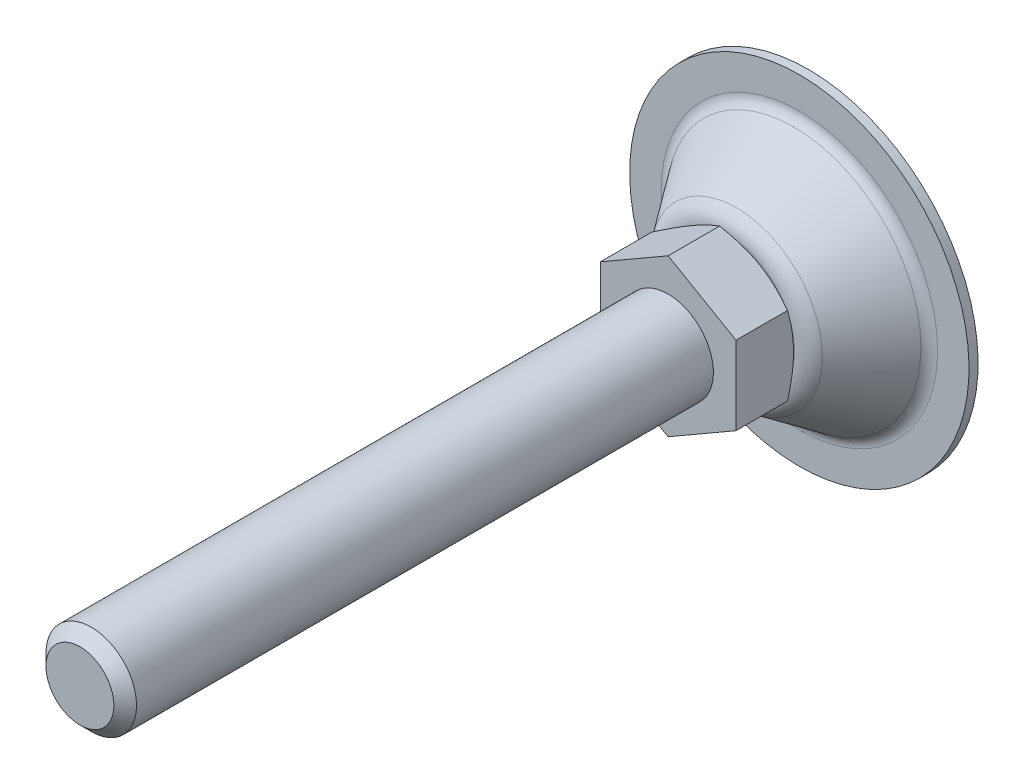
ISO-10303-21;
HEADER;
FILE_DESCRIPTION(('STEP AP214'),'2;1');
FILE_NAME('part.step','',(''),(''),'','','');
FILE_SCHEMA(('AUTOMOTIVE_DESIGN { 1 0 10303 214 1 1 1 1 }'));
ENDSEC;
DATA;
#1=APPLICATION_CONTEXT('core data for automotive mechanical design processes');
#2=APPLICATION_PROTOCOL_DEFINITION('international standard','automotive_design',2000,#1);
#3=PRODUCT_CONTEXT('',#1,'mechanical');
#4=PRODUCT('Part','Part','',(#3));
#5=PRODUCT_RELATED_PRODUCT_CATEGORY('part','',(#4));
#6=PRODUCT_DEFINITION_FORMATION('','',#4);
#7=PRODUCT_DEFINITION_CONTEXT('part definition',#1,'design');
#8=PRODUCT_DEFINITION('design','',#6,#7);
#9=PRODUCT_DEFINITION_SHAPE('','',#8);
#10=(LENGTH_UNIT() NAMED_UNIT(*) SI_UNIT(.MILLI.,.METRE.));
#11=(NAMED_UNIT(*) PLANE_ANGLE_UNIT() SI_UNIT($,.RADIAN.));
#12=(NAMED_UNIT(*) SI_UNIT($,.STERADIAN.) SOLID_ANGLE_UNIT());
#13=UNCERTAINTY_MEASURE_WITH_UNIT(LENGTH_MEASURE(1.E-05),#10,'distance_accuracy_value','');
#14=(GEOMETRIC_REPRESENTATION_CONTEXT(3) GLOBAL_UNCERTAINTY_ASSIGNED_CONTEXT((#13)) GLOBAL_UNIT_ASSIGNED_CONTEXT((#10,
#11,#12)) REPRESENTATION_CONTEXT('',''));
#15=CARTESIAN_POINT('',(0.,0.,0.));
#16=DIRECTION('',(0.,0.,1.));
#17=DIRECTION('',(1.,0.,0.));
#18=AXIS2_PLACEMENT_3D('',#15,#16,#17);
#19=CARTESIAN_POINT('',(0.,0.,31.));
#20=DIRECTION('',(0.,0.,1.));
#21=DIRECTION('',(0.5,-0.86602540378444,0.));
#22=AXIS2_PLACEMENT_3D('',#19,#20,#21);
#23=PLANE('',#22);
#24=DIRECTION('',(0.,1.,0.));
#25=VECTOR('',#24,1.);
#26=CARTESIAN_POINT('',(15.,-8.66025403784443,31.));
#27=LINE('',#26,#25);
#28=CARTESIAN_POINT('',(15.,-8.66025403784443,31.));
#29=VERTEX_POINT('',#28);
#30=CARTESIAN_POINT('',(15.,8.66025403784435,31.));
#31=VERTEX_POINT('',#30);
#32=EDGE_CURVE('E220',#29,#31,#27,.T.);
#33=ORIENTED_EDGE('',*,*,#32,.T.);
#34=DIRECTION('',(-0.866025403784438,0.5,0.));
#35=VECTOR('',#34,1.);
#36=CARTESIAN_POINT('',(15.,8.66025403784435,31.));
#37=LINE('',#36,#35);
#38=CARTESIAN_POINT('',(0.,17.3205080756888,31.));
#39=VERTEX_POINT('',#38);
#40=EDGE_CURVE('E266',#31,#39,#37,.T.);
#41=ORIENTED_EDGE('',*,*,#40,.T.);
#42=DIRECTION('',(-0.866025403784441,-0.5,0.));
#43=VECTOR('',#42,1.);
#44=CARTESIAN_POINT('',(0.,17.3205080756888,31.));
#45=LINE('',#44,#43);
#46=CARTESIAN_POINT('',(-15.,8.66025403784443,31.));
#47=VERTEX_POINT('',#46);
#48=EDGE_CURVE('E264',#39,#47,#45,.T.);
#49=ORIENTED_EDGE('',*,*,#48,.T.);
#50=DIRECTION('',(0.,-1.,0.));
#51=VECTOR('',#50,1.);
#52=CARTESIAN_POINT('',(-15.,8.66025403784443,31.));
#53=LINE('',#52,#51);
#54=CARTESIAN_POINT('',(-15.,-8.66025403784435,31.));
#55=VERTEX_POINT('',#54);
#56=EDGE_CURVE('E261',#47,#55,#53,.T.);
#57=ORIENTED_EDGE('',*,*,#56,.T.);
#58=DIRECTION('',(0.866025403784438,-0.5,0.));
#59=VECTOR('',#58,1.);
#60=CARTESIAN_POINT('',(-15.,-8.66025403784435,31.));
#61=LINE('',#60,#59);
#62=CARTESIAN_POINT('',(0.,-17.3205080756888,31.));
#63=VERTEX_POINT('',#62);
#64=EDGE_CURVE('E271',#55,#63,#61,.T.);
#65=ORIENTED_EDGE('',*,*,#64,.T.);
#66=DIRECTION('',(0.866025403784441,0.5,0.));
#67=VECTOR('',#66,1.);
#68=CARTESIAN_POINT('',(0.,-17.3205080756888,31.));
#69=LINE('',#68,#67);
#70=EDGE_CURVE('E37',#63,#29,#69,.T.);
#71=ORIENTED_EDGE('',*,*,#70,.T.);
#72=EDGE_LOOP('',(#33,#41,#49,#57,#65,#71));
#73=FACE_BOUND('',#72,.T.);
#74=CARTESIAN_POINT('',(0.,0.,31.));
#75=DIRECTION('',(0.,0.,1.));
#76=DIRECTION('',(0.5,-0.86602540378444,0.));
#77=AXIS2_PLACEMENT_3D('',#74,#75,#76);
#78=CIRCLE('',#77,10.);
#79=CARTESIAN_POINT('',(5.,-8.6602540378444,31.));
#80=VERTEX_POINT('',#79);
#81=EDGE_CURVE('E224',#80,#80,#78,.T.);
#82=ORIENTED_EDGE('',*,*,#81,.F.);
#83=EDGE_LOOP('',(#82));
#84=FACE_BOUND('',#83,.T.);
#85=ADVANCED_FACE('F14',(#73,#84),#23,.T.);
#86=CARTESIAN_POINT('',(-1.54390389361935E-13,2.67411998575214E-13,4.9999999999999));
#87=DIRECTION('',(0.,0.,1.));
#88=DIRECTION('',(0.5,-0.86602540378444,0.));
#89=AXIS2_PLACEMENT_3D('',#86,#87,#88);
#90=TOROIDAL_SURFACE('',#89,30.5382613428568,3.);
#91=CARTESIAN_POINT('',(-1.55741344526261E-13,2.69751921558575E-13,3.24909185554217));
#92=DIRECTION('',(0.,0.,1.));
#93=DIRECTION('',(0.5,-0.86602540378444,0.));
#94=AXIS2_PLACEMENT_3D('',#91,#92,#93);
#95=CIRCLE('',#94,28.1022152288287);
#96=CARTESIAN_POINT('',(14.0511076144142,-24.3372322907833,3.2490918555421));
#97=VERTEX_POINT('',#96);
#98=EDGE_CURVE('E73',#97,#97,#95,.T.);
#99=ORIENTED_EDGE('',*,*,#98,.F.);
#100=EDGE_LOOP('',(#99));
#101=FACE_BOUND('',#100,.T.);
#102=CARTESIAN_POINT('',(-1.57301461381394E-13,2.72454123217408E-13,1.99999999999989));
#103=DIRECTION('',(0.,0.,1.));
#104=DIRECTION('',(0.5,-0.86602540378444,0.));
#105=AXIS2_PLACEMENT_3D('',#102,#103,#104);
#106=CIRCLE('',#105,30.5382613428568);
#107=CARTESIAN_POINT('',(15.2691306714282,-26.446910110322,1.99999999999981));
#108=VERTEX_POINT('',#107);
#109=EDGE_CURVE('E102',#108,#108,#106,.T.);
#110=ORIENTED_EDGE('',*,*,#109,.T.);
#111=EDGE_LOOP('',(#110));
#112=FACE_BOUND('',#111,.T.);
#113=ADVANCED_FACE('F198',(#101,#112),#90,.F.);
#114=CARTESIAN_POINT('',(-1.55741344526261E-13,2.69751921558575E-13,3.24909185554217));
#115=DIRECTION('',(0.,0.,-1.));
#116=DIRECTION('',(-0.5,0.86602540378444,0.));
#117=AXIS2_PLACEMENT_3D('',#114,#115,#116);
#118=CONICAL_SURFACE('',#117,28.1022152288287,0.623199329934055);
#119=CARTESIAN_POINT('',(-1.39917641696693E-13,2.42344464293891E-13,15.9181802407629));
#120=DIRECTION('',(0.,0.,1.));
#121=DIRECTION('',(0.5,-0.86602540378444,0.));
#122=AXIS2_PLACEMENT_3D('',#119,#120,#121);
#123=CIRCLE('',#122,18.9963079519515);
#124=CARTESIAN_POINT('',(9.49815397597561,-16.4512852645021,15.9181802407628));
#125=VERTEX_POINT('',#124);
#126=EDGE_CURVE('E111',#125,#125,#123,.T.);
#127=ORIENTED_EDGE('',*,*,#126,.F.);
#128=EDGE_LOOP('',(#127));
#129=FACE_BOUND('',#128,.T.);
#130=ORIENTED_EDGE('',*,*,#98,.T.);
#131=EDGE_LOOP('',(#130));
#132=FACE_BOUND('',#131,.T.);
#133=ADVANCED_FACE('F195',(#129,#132),#118,.T.);
#134=CARTESIAN_POINT('',(-1.43982048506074E-13,2.49384223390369E-13,13.));
#135=DIRECTION('',(0.,0.,1.));
#136=DIRECTION('',(0.5,-0.86602540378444,0.));
#137=AXIS2_PLACEMENT_3D('',#134,#135,#136);
#138=TOROIDAL_SURFACE('',#137,14.9362310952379,5.);
#139=CARTESIAN_POINT('',(-1.43982048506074E-13,2.49384223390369E-13,18.));
#140=DIRECTION('',(0.,0.,1.));
#141=DIRECTION('',(0.5,-0.86602540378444,0.));
#142=AXIS2_PLACEMENT_3D('',#139,#140,#141);
#143=CIRCLE('',#142,14.9362310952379);
#144=CARTESIAN_POINT('',(7.46811554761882,-12.9351555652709,18.));
#145=VERTEX_POINT('',#144);
#146=EDGE_CURVE('E84',#145,#145,#143,.T.);
#147=ORIENTED_EDGE('',*,*,#146,.F.);
#148=EDGE_LOOP('',(#147));
#149=FACE_BOUND('',#148,.T.);
#150=ORIENTED_EDGE('',*,*,#126,.T.);
#151=EDGE_LOOP('',(#150));
#152=FACE_BOUND('',#151,.T.);
#153=ADVANCED_FACE('F191',(#149,#152),#138,.T.);
#154=CARTESIAN_POINT('',(-18.75,32.4759526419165,0.));
#155=DIRECTION('',(0.,0.,1.));
#156=DIRECTION('',(0.5,-0.86602540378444,0.));
#157=AXIS2_PLACEMENT_3D('',#154,#155,#156);
#158=PLANE('',#157);
#159=CARTESIAN_POINT('',(-1.59799463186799E-13,2.76780789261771E-13,-1.38777878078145E-13));
#160=DIRECTION('',(0.,0.,1.));
#161=DIRECTION('',(0.5,-0.86602540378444,0.));
#162=AXIS2_PLACEMENT_3D('',#159,#160,#161);
#163=CIRCLE('',#162,37.5);
#164=CARTESIAN_POINT('',(18.7499999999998,-32.4759526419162,-2.32452945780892E-13));
#165=VERTEX_POINT('',#164);
#166=EDGE_CURVE('E108',#165,#165,#163,.T.);
#167=ORIENTED_EDGE('',*,*,#166,.F.);
#168=EDGE_LOOP('',(#167));
#169=FACE_BOUND('',#168,.T.);
#170=ADVANCED_FACE('F187',(#169),#158,.F.);
#171=CARTESIAN_POINT('',(0.,0.,129.670029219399));
#172=DIRECTION('',(0.,0.,1.));
#173=DIRECTION('',(0.5,-0.86602540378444,0.));
#174=AXIS2_PLACEMENT_3D('',#171,#172,#173);
#175=CYLINDRICAL_SURFACE('',#174,37.5);
#176=CARTESIAN_POINT('',(-1.57301461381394E-13,2.72454123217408E-13,1.99999999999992));
#177=DIRECTION('',(0.,0.,1.));
#178=DIRECTION('',(0.5,-0.86602540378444,0.));
#179=AXIS2_PLACEMENT_3D('',#176,#177,#178);
#180=CIRCLE('',#179,37.5);
#181=CARTESIAN_POINT('',(18.7499999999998,-32.4759526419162,1.99999999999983));
#182=VERTEX_POINT('',#181);
#183=EDGE_CURVE('E105',#182,#182,#180,.T.);
#184=ORIENTED_EDGE('',*,*,#183,.F.);
#185=EDGE_LOOP('',(#184));
#186=FACE_BOUND('',#185,.T.);
#187=ORIENTED_EDGE('',*,*,#166,.T.);
#188=EDGE_LOOP('',(#187));
#189=FACE_BOUND('',#188,.T.);
#190=ADVANCED_FACE('F183',(#186,#189),#175,.T.);
#191=CARTESIAN_POINT('',(-18.75,32.4759526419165,2.));
#192=DIRECTION('',(0.,0.,-1.));
#193=DIRECTION('',(-0.5,0.86602540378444,0.));
#194=AXIS2_PLACEMENT_3D('',#191,#192,#193);
#195=PLANE('',#194);
#196=ORIENTED_EDGE('',*,*,#109,.F.);
#197=EDGE_LOOP('',(#196));
#198=FACE_BOUND('',#197,.T.);
#199=ORIENTED_EDGE('',*,*,#183,.T.);
#200=EDGE_LOOP('',(#199));
#201=FACE_BOUND('',#200,.T.);
#202=ADVANCED_FACE('F128',(#198,#201),#195,.F.);
#203=CARTESIAN_POINT('',(0.,0.,23.0943491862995));
#204=DIRECTION('',(0.,0.,1.));
#205=DIRECTION('',(0.5,-0.86602540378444,0.));
#206=AXIS2_PLACEMENT_3D('',#203,#204,#205);
#207=CONICAL_SURFACE('',#206,23.323671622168,1.0471975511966);
#208=CARTESIAN_POINT('',(0.,0.,18.));
#209=DIRECTION('',(0.,0.,-1.));
#210=DIRECTION('',(-0.5,0.86602540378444,0.));
#211=AXIS2_PLACEMENT_3D('',#208,#209,#210);
#212=CIRCLE('',#211,14.5);
#213=CARTESIAN_POINT('',(-7.25,12.5573683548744,18.));
#214=VERTEX_POINT('',#213);
#215=EDGE_CURVE('E226',#214,#214,#212,.T.);
#216=ORIENTED_EDGE('',*,*,#215,.F.);
#217=EDGE_LOOP('',(#216));
#218=FACE_BOUND('',#217,.T.);
#219=CARTESIAN_POINT('',(-12.7752963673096,-24.6963288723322,25.6816332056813));
#220=CARTESIAN_POINT('',(-12.4910694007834,-24.5322303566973,25.5220895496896));
#221=CARTESIAN_POINT('',(-12.206512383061,-24.3679412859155,25.3633302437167));
#222=CARTESIAN_POINT('',(-11.6366694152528,-24.0389422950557,25.0475576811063));
#223=CARTESIAN_POINT('',(-11.3513834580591,-23.8742323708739,24.8905444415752));
#224=CARTESIAN_POINT('',(-10.4942547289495,-23.3793688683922,24.4223494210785));
#225=CARTESIAN_POINT('',(-9.92122319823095,-23.0485289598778,24.1140585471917));
#226=CARTESIAN_POINT('',(-8.76831153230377,-22.3828950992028,23.5053939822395));
#227=CARTESIAN_POINT('',(-8.18841117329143,-22.0480894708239,23.2050712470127));
#228=CARTESIAN_POINT('',(-7.02404380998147,-21.3758416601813,22.6165131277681));
#229=CARTESIAN_POINT('',(-6.43957701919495,-21.0383996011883,22.3282771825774));
#230=CARTESIAN_POINT('',(-5.24579106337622,-20.3491669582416,21.7578369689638));
#231=CARTESIAN_POINT('',(-4.6362875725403,-19.9972699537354,21.4761443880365));
#232=CARTESIAN_POINT('',(-3.41019349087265,-19.2893842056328,20.9337181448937));
#233=CARTESIAN_POINT('',(-2.79360212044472,-18.9333950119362,20.6729868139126));
#234=CARTESIAN_POINT('',(-1.55348395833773,-18.2174124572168,20.1792225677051));
#235=CARTESIAN_POINT('',(-0.929973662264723,-17.8574286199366,19.9461348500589));
#236=CARTESIAN_POINT('',(0.326048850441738,-17.1322636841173,19.5150244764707));
#237=CARTESIAN_POINT('',(0.958558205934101,-16.7670842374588,19.3169909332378));
#238=CARTESIAN_POINT('',(1.91243675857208,-16.216362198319,19.0538662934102));
#239=CARTESIAN_POINT('',(2.2303543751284,-16.0328123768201,18.9719940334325));
#240=CARTESIAN_POINT('',(2.8683856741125,-15.6644448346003,18.8205188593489));
#241=CARTESIAN_POINT('',(3.18849931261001,-15.4796271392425,18.7509157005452));
#242=CARTESIAN_POINT('',(3.83071190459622,-15.1088455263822,18.6251978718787));
#243=CARTESIAN_POINT('',(4.15281082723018,-14.9228816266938,18.5690829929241));
#244=CARTESIAN_POINT('',(4.79866142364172,-14.5499996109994,18.4714557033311));
#245=CARTESIAN_POINT('',(5.12241302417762,-14.3630815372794,18.4299426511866));
#246=CARTESIAN_POINT('',(5.7668346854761,-13.9910245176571,18.3628722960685));
#247=CARTESIAN_POINT('',(6.08748870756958,-13.8058948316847,18.3371107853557));
#248=CARTESIAN_POINT('',(6.72945271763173,-13.4352567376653,18.3012764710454));
#249=CARTESIAN_POINT('',(7.05076269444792,-13.2497483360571,18.2912034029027));
#250=CARTESIAN_POINT('',(7.69346432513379,-12.878684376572,18.2869861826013));
#251=CARTESIAN_POINT('',(8.0148559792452,-12.6931288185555,18.2928420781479));
#252=CARTESIAN_POINT('',(8.65713622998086,-12.3223081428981,18.3203381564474));
#253=CARTESIAN_POINT('',(8.9780248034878,-12.1370430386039,18.3419790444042));
#254=CARTESIAN_POINT('',(9.74531187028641,-11.694049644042,18.4121345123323));
#255=CARTESIAN_POINT('',(10.1912229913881,-11.4366027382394,18.4678874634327));
#256=CARTESIAN_POINT('',(11.0798234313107,-10.9235690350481,18.6068735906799));
#257=CARTESIAN_POINT('',(11.5225123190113,-10.6679824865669,18.6901103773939));
#258=CARTESIAN_POINT('',(12.4042155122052,-10.158930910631,18.881103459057));
#259=CARTESIAN_POINT('',(12.84322676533,-9.90546764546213,18.988878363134));
#260=CARTESIAN_POINT('',(13.7168888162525,-9.40105862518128,19.2256508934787));
#261=CARTESIAN_POINT('',(14.151539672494,-9.15011283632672,19.3546482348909));
#262=CARTESIAN_POINT('',(15.0261682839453,-8.64514577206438,19.6338079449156));
#263=CARTESIAN_POINT('',(15.466047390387,-8.39118145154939,19.7843795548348));
#264=CARTESIAN_POINT('',(16.3414739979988,-7.8857536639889,20.1013827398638));
#265=CARTESIAN_POINT('',(16.7770214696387,-7.63429021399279,20.267814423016));
#266=CARTESIAN_POINT('',(17.6439961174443,-7.13374216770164,20.6138686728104));
#267=CARTESIAN_POINT('',(18.0754245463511,-6.88465684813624,20.7934870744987));
#268=CARTESIAN_POINT('',(18.9346884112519,-6.38856062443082,21.1637718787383));
#269=CARTESIAN_POINT('',(19.3625238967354,-6.14154969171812,21.3544381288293));
#270=CARTESIAN_POINT('',(20.4004383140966,-5.54230952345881,21.829942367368));
#271=CARTESIAN_POINT('',(21.0088362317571,-5.19105082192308,22.1196663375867));
#272=CARTESIAN_POINT('',(22.2202116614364,-4.49166289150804,22.7138939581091));
#273=CARTESIAN_POINT('',(22.8231887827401,-4.14353388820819,23.0183986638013));
#274=CARTESIAN_POINT('',(24.0247789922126,-3.44979545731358,23.6391170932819));
#275=CARTESIAN_POINT('',(24.6233909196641,-3.10418669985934,23.9553338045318));
#276=CARTESIAN_POINT('',(25.8168545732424,-2.41514013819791,24.5970218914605));
#277=CARTESIAN_POINT('',(26.4117063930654,-2.07170227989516,24.9224930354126));
#278=CARTESIAN_POINT('',(27.5990157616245,-1.38620889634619,25.5812970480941));
#279=CARTESIAN_POINT('',(28.1914695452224,-1.04415554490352,25.9146389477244));
#280=CARTESIAN_POINT('',(29.3737746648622,-0.36155136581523,26.5874202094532));
#281=CARTESIAN_POINT('',(29.9636259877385,-0.0210005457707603,26.9268596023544));
#282=CARTESIAN_POINT('',(31.1410545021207,0.658788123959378,27.6107079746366));
#283=CARTESIAN_POINT('',(31.728632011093,0.998026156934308,27.9551162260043));
#284=CARTESIAN_POINT('',(32.9019328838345,1.67543173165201,28.6481104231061));
#285=CARTESIAN_POINT('',(33.4876562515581,2.01359927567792,28.9966963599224));
#286=CARTESIAN_POINT('',(35.1389838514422,2.96699370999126,29.9857106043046));
#287=CARTESIAN_POINT('',(36.2027654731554,3.5811683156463,30.6301961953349));
#288=CARTESIAN_POINT('',(38.3264251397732,4.80726379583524,31.9277855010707));
#289=CARTESIAN_POINT('',(39.3863030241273,5.4191845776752,32.5808895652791));
#290=CARTESIAN_POINT('',(41.5001458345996,6.63961229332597,33.8918828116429));
#291=CARTESIAN_POINT('',(42.5541189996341,7.24812398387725,34.5497542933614));
#292=CARTESIAN_POINT('',(44.1332517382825,8.15983669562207,35.5403535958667));
#293=CARTESIAN_POINT('',(44.6593093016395,8.46355617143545,35.8711755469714));
#294=CARTESIAN_POINT('',(45.7108863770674,9.07068447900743,36.5339556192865));
#295=CARTESIAN_POINT('',(46.2364058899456,9.37409331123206,36.865913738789));
#296=CARTESIAN_POINT('',(46.7616874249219,9.67736474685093,37.1983733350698));
#297=B_SPLINE_CURVE_WITH_KNOTS('',3,(#219,#220,#221,#222,#223,#224,#225,#226,#227,#228,#229,
#230,#231,#232,#233,#234,#235,#236,#237,#238,#239,#240,#241,#242,#243,#244,#245,#246,#247,#248,
#249,#250,#251,#252,#253,#254,#255,#256,#257,#258,#259,#260,#261,#262,#263,#264,#265,#266,#267,
#268,#269,#270,#271,#272,#273,#274,#275,#276,#277,#278,#279,#280,#281,#282,#283,#284,#285,#286,
#287,#288,#289,#290,#291,#292,#293,#294,#295,#296),.UNSPECIFIED.,.F.,.F.,(4,2,2,2,2,2,2,2,2,2,2,
2,2,2,2,2,2,2,2,2,2,2,2,2,2,2,2,2,2,2,2,2,2,2,2,2,2,2,4),(0.,1.09476161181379,2.18953393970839,
4.37939496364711,6.58092776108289,8.7823582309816,11.0563262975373,13.3305469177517,
15.6001808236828,17.869108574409,18.9972925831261,20.1254540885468,21.2535981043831,
22.3816925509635,23.4948335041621,24.6079556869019,25.7210812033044,26.8342564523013,
28.3871111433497,29.9401699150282,31.4944104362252,33.0486300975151,34.6376511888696,
36.2266831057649,37.815215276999,39.4037255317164,41.6832356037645,43.9629086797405,
46.2431673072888,48.5233688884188,50.8063278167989,53.0892982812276,55.3719375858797,
57.6545720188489,61.8159896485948,65.9775765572,70.1279174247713,72.2029652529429,
74.2780099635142),.UNSPECIFIED.);
#298=CARTESIAN_POINT('',(0.,-17.3205080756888,19.6284210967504));
#299=VERTEX_POINT('',#298);
#300=CARTESIAN_POINT('',(15.,-8.66025403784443,19.6284210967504));
#301=VERTEX_POINT('',#300);
#302=EDGE_CURVE('E65',#299,#301,#297,.T.);
#303=ORIENTED_EDGE('',*,*,#302,.F.);
#304=CARTESIAN_POINT('',(-15.0002,-8.66013856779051,19.6284877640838));
#305=CARTESIAN_POINT('',(-14.6705058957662,-8.85048754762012,19.5185969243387));
#306=CARTESIAN_POINT('',(-14.3395258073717,-9.04157899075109,19.4136927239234));
#307=CARTESIAN_POINT('',(-13.674911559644,-9.42529420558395,19.2152437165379));
#308=CARTESIAN_POINT('',(-13.3412765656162,-9.61791845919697,19.1217026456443));
#309=CARTESIAN_POINT('',(-12.6707077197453,-10.0050715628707,18.9472372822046));
#310=CARTESIAN_POINT('',(-12.333767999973,-10.1996038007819,18.866342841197));
#311=CARTESIAN_POINT('',(-11.6575472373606,-10.5900200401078,18.7189077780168));
#312=CARTESIAN_POINT('',(-11.3182663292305,-10.7859039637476,18.6523663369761));
#313=CARTESIAN_POINT('',(-10.6460568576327,-11.1740042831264,18.5364675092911));
#314=CARTESIAN_POINT('',(-10.3131781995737,-11.3661918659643,18.4867265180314));
#315=CARTESIAN_POINT('',(-9.64589556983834,-11.7514476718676,18.4033218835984));
#316=CARTESIAN_POINT('',(-9.31149156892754,-11.9445159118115,18.3696585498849));
#317=CARTESIAN_POINT('',(-8.64212181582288,-12.3309767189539,18.3192592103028));
#318=CARTESIAN_POINT('',(-8.30715720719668,-12.5243686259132,18.3025030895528));
#319=CARTESIAN_POINT('',(-7.63691878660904,-12.9113309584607,18.2862785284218));
#320=CARTESIAN_POINT('',(-7.3016449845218,-13.104901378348,18.2868095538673));
#321=CARTESIAN_POINT('',(-6.67485311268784,-13.4667798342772,18.303951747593));
#322=CARTESIAN_POINT('',(-6.38329037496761,-13.6351136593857,18.3184719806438));
#323=CARTESIAN_POINT('',(-5.80083556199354,-13.971394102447,18.3603122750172));
#324=CARTESIAN_POINT('',(-5.50994353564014,-14.1393406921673,18.3876332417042));
#325=CARTESIAN_POINT('',(-4.9289881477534,-14.4747554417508,18.4545986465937));
#326=CARTESIAN_POINT('',(-4.63892567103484,-14.6422230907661,18.4942532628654));
#327=CARTESIAN_POINT('',(-4.06016058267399,-14.9763732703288,18.5851902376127));
#328=CARTESIAN_POINT('',(-3.77145806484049,-15.1430557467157,18.636473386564));
#329=CARTESIAN_POINT('',(-2.89508556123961,-15.6490296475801,18.8090619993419));
#330=CARTESIAN_POINT('',(-2.30995340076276,-15.9868558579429,18.9475763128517));
#331=CARTESIAN_POINT('',(-1.14841408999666,-16.657470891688,19.26194710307));
#332=CARTESIAN_POINT('',(-0.571992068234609,-16.9902683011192,19.4377297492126));
#333=CARTESIAN_POINT('',(0.000199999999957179,-17.3206235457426,19.6284877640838));
#334=B_SPLINE_CURVE_WITH_KNOTS('',3,(#304,#305,#306,#307,#308,#309,#310,#311,#312,#313,#314,
#315,#316,#317,#318,#319,#320,#321,#322,#323,#324,#325,#326,#327,#328,#329,#330,#331,#332,#333),
.UNSPECIFIED.,.F.,.F.,(4,2,2,2,2,2,2,2,2,2,2,2,2,2,4),(0.,1.18875411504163,2.37789802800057,
3.56980778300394,4.76164951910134,5.92407379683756,7.08652044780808,8.24758247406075,
9.40860862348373,10.4193068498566,11.4300765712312,12.4416826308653,13.4533574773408,
15.5211962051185,17.5849760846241),.UNSPECIFIED.);
#335=CARTESIAN_POINT('',(-15.,-8.66025403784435,19.6284210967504));
#336=VERTEX_POINT('',#335);
#337=EDGE_CURVE('E68',#336,#299,#334,.T.);
#338=ORIENTED_EDGE('',*,*,#337,.F.);
#339=CARTESIAN_POINT('',(-15.,8.66048497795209,19.6284877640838));
#340=CARTESIAN_POINT('',(-15.,8.27978701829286,19.5185969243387));
#341=CARTESIAN_POINT('',(-15.,7.89760413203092,19.4136927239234));
#342=CARTESIAN_POINT('',(-15.,7.1301737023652,19.2152437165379));
#343=CARTESIAN_POINT('',(-15.,6.74492519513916,19.1217026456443));
#344=CARTESIAN_POINT('',(-15.,5.97061898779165,18.9472372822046));
#345=CARTESIAN_POINT('',(-15.,5.58155451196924,18.866342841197));
#346=CARTESIAN_POINT('',(-15.,4.80072203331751,18.7189077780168));
#347=CARTESIAN_POINT('',(-15.,4.40895418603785,18.6523663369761));
#348=CARTESIAN_POINT('',(-15.,3.63275354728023,18.5364675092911));
#349=CARTESIAN_POINT('',(-15.,3.24837838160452,18.4867265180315));
#350=CARTESIAN_POINT('',(-15.,2.47786676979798,18.4033218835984));
#351=CARTESIAN_POINT('',(-15.,2.09173028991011,18.3696585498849));
#352=CARTESIAN_POINT('',(-15.,1.31880867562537,18.3192592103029));
#353=CARTESIAN_POINT('',(-15.,0.932024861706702,18.3025030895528));
#354=CARTESIAN_POINT('',(-15.,0.158100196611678,18.2862785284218));
#355=CARTESIAN_POINT('',(-15.,-0.229040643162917,18.2868095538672));
#356=CARTESIAN_POINT('',(-15.,-0.95279755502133,18.303951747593));
#357=CARTESIAN_POINT('',(-15.,-1.2894652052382,18.3184719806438));
#358=CARTESIAN_POINT('',(-15.,-1.96202609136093,18.3603122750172));
#359=CARTESIAN_POINT('',(-15.,-2.29791927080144,18.3876332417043));
#360=CARTESIAN_POINT('',(-15.,-2.96874876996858,18.4545986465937));
#361=CARTESIAN_POINT('',(-15.,-3.30368406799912,18.4942532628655));
#362=CARTESIAN_POINT('',(-15.,-3.97198442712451,18.5851902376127));
#363=CARTESIAN_POINT('',(-15.,-4.30534937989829,18.636473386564));
#364=CARTESIAN_POINT('',(-15.,-5.317297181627,18.8090619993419));
#365=CARTESIAN_POINT('',(-15.,-5.99294960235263,18.9475763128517));
#366=CARTESIAN_POINT('',(-15.,-7.33417966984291,19.26194710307));
#367=CARTESIAN_POINT('',(-15.,-7.99977448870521,19.4377297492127));
#368=CARTESIAN_POINT('',(-15.,-8.66048497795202,19.6284877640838));
#369=B_SPLINE_CURVE_WITH_KNOTS('',3,(#339,#340,#341,#342,#343,#344,#345,#346,#347,#348,#349,
#350,#351,#352,#353,#354,#355,#356,#357,#358,#359,#360,#361,#362,#363,#364,#365,#366,#367,#368),
.UNSPECIFIED.,.F.,.F.,(4,2,2,2,2,2,2,2,2,2,2,2,2,2,4),(0.,1.18875411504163,2.37789802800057,
3.56980778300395,4.76164951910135,5.92407379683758,7.08652044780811,8.24758247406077,
9.40860862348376,10.4193068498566,11.4300765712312,12.4416826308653,13.4533574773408,
15.5211962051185,17.5849760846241),.UNSPECIFIED.);
#370=CARTESIAN_POINT('',(-15.,8.66025403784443,19.6284210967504));
#371=VERTEX_POINT('',#370);
#372=EDGE_CURVE('E83',#371,#336,#369,.T.);
#373=ORIENTED_EDGE('',*,*,#372,.F.);
#374=CARTESIAN_POINT('',(-27.7752963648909,1.28443324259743,25.6816332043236));
#375=CARTESIAN_POINT('',(-27.4910693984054,1.44853175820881,25.5220895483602));
#376=CARTESIAN_POINT('',(-27.2065123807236,1.61282082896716,25.3633302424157));
#377=CARTESIAN_POINT('',(-26.6366694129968,1.94181981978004,25.0475576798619));
#378=CARTESIAN_POINT('',(-26.3513834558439,2.10652974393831,24.8905444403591));
#379=CARTESIAN_POINT('',(-25.4942547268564,2.60139324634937,24.4223494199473));
#380=CARTESIAN_POINT('',(-24.9212231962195,2.93223315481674,24.1140585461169));
#381=CARTESIAN_POINT('',(-23.7683115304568,3.59786701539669,23.5053939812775));
#382=CARTESIAN_POINT('',(-23.1884111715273,3.93267264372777,23.2050712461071));
#383=CARTESIAN_POINT('',(-22.0240438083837,4.60492045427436,22.6165131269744));
#384=CARTESIAN_POINT('',(-21.4395770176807,4.94236251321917,22.3282771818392));
#385=CARTESIAN_POINT('',(-20.2457910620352,5.63159515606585,21.7578369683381));
#386=CARTESIAN_POINT('',(-19.6362875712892,5.98349216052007,21.4761443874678));
#387=CARTESIAN_POINT('',(-18.4101934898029,6.69137790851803,20.9337181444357));
#388=CARTESIAN_POINT('',(-17.7936021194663,7.04736710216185,20.6729868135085));
#389=CARTESIAN_POINT('',(-16.5534839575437,7.76334965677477,20.1792225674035));
#390=CARTESIAN_POINT('',(-15.9299736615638,8.1233334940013,19.946134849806));
#391=CARTESIAN_POINT('',(-14.673951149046,8.84849842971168,19.5150244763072));
#392=CARTESIAN_POINT('',(-14.0414417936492,9.21367787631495,19.316990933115));
#393=CARTESIAN_POINT('',(-13.0875632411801,9.76439991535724,19.0538662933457));
#394=CARTESIAN_POINT('',(-12.769645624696,9.94794973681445,18.9719940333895));
#395=CARTESIAN_POINT('',(-12.1316143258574,10.3163172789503,18.8205188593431));
#396=CARTESIAN_POINT('',(-11.8115006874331,10.5011349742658,18.7509157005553));
#397=CARTESIAN_POINT('',(-11.1692880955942,10.871916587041,18.6251978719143));
#398=CARTESIAN_POINT('',(-10.8471891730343,11.0578804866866,18.5690829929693));
#399=CARTESIAN_POINT('',(-10.2013385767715,11.4307625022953,18.4714557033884));
#400=CARTESIAN_POINT('',(-9.87758697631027,11.6176805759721,18.4299426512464));
#401=CARTESIAN_POINT('',(-9.23316531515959,11.9897375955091,18.3628722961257));
#402=CARTESIAN_POINT('',(-8.91251129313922,12.1748672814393,18.337110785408));
#403=CARTESIAN_POINT('',(-8.27054728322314,12.5455053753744,18.3012764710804));
#404=CARTESIAN_POINT('',(-7.9492373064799,12.7310137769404,18.2912034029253));
#405=CARTESIAN_POINT('',(-7.3065356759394,13.1020777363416,18.2869861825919));
#406=CARTESIAN_POINT('',(-6.98514402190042,13.2876332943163,18.2928420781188));
#407=CARTESIAN_POINT('',(-6.34286377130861,13.6584539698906,18.3203381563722));
#408=CARTESIAN_POINT('',(-6.02197519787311,13.8437190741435,18.3419790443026));
#409=CARTESIAN_POINT('',(-5.25468813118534,14.2867124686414,18.4121345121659));
#410=CARTESIAN_POINT('',(-4.80877701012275,14.5441593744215,18.4678874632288));
#411=CARTESIAN_POINT('',(-3.92017657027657,15.0571930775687,18.6068735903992));
#412=CARTESIAN_POINT('',(-3.47748768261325,15.3127796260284,18.6901103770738));
#413=CARTESIAN_POINT('',(-2.59578448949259,15.821831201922,18.8811034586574));
#414=CARTESIAN_POINT('',(-2.15677323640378,16.0752944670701,18.9888783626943));
#415=CARTESIAN_POINT('',(-1.28311118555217,16.57970348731,19.2256508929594));
#416=CARTESIAN_POINT('',(-0.84846032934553,16.8306492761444,19.3546482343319));
#417=CARTESIAN_POINT('',(0.0261682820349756,17.3356163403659,19.6338079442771));
#418=CARTESIAN_POINT('',(0.466047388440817,17.5895806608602,19.7843795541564));
#419=CARTESIAN_POINT('',(1.34147399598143,18.0950084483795,20.1013827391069));
#420=CARTESIAN_POINT('',(1.7770214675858,18.3464718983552,20.2678144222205));
#421=CARTESIAN_POINT('',(2.64399611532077,18.8470199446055,20.6138686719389));
#422=CARTESIAN_POINT('',(3.07542454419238,19.0961052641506,20.7934870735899));
#423=CARTESIAN_POINT('',(3.93468840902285,19.5922014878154,21.1637718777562));
#424=CARTESIAN_POINT('',(4.36252389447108,19.8392124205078,21.3544381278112));
#425=CARTESIAN_POINT('',(5.40043831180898,20.4384525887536,21.8299423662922));
#426=CARTESIAN_POINT('',(6.0088362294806,20.7897112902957,22.1196663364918));
#427=CARTESIAN_POINT('',(7.22021165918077,21.4890992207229,22.7138939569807));
#428=CARTESIAN_POINT('',(7.82318878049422,21.8372282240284,23.0183986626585));
#429=CARTESIAN_POINT('',(9.0247789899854,22.5309666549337,23.639117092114));
#430=CARTESIAN_POINT('',(9.62339091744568,22.876575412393,23.955333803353));
#431=CARTESIAN_POINT('',(10.8168545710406,23.5656219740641,24.5970218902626));
#432=CARTESIAN_POINT('',(11.4117063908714,23.9090598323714,24.9224930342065));
#433=CARTESIAN_POINT('',(12.5990157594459,24.5945532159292,25.5812970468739));
#434=CARTESIAN_POINT('',(13.1914695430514,24.9366065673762,25.9146389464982));
#435=CARTESIAN_POINT('',(14.3737746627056,25.6192107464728,26.5874202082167));
#436=CARTESIAN_POINT('',(14.9636259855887,25.9597615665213,26.9268596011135));
#437=CARTESIAN_POINT('',(16.1410544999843,26.6395502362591,27.6107079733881));
#438=CARTESIAN_POINT('',(16.728632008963,26.9787882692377,27.9551162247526));
#439=CARTESIAN_POINT('',(17.9019328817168,27.6561938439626,28.6481104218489));
#440=CARTESIAN_POINT('',(18.4876562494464,27.9943613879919,28.996696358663));
#441=CARTESIAN_POINT('',(20.1389838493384,28.9477558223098,29.9857106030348));
#442=CARTESIAN_POINT('',(21.202765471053,29.5619304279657,30.6301961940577));
#443=CARTESIAN_POINT('',(23.3264251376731,30.788025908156,31.9277854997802));
#444=CARTESIAN_POINT('',(24.386303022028,31.3999466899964,32.5808895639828));
#445=CARTESIAN_POINT('',(26.5001458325,32.620374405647,33.8918828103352));
#446=CARTESIAN_POINT('',(27.5541189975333,33.2288860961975,34.549754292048));
#447=CARTESIAN_POINT('',(29.1332517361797,34.1405988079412,35.5403535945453));
#448=CARTESIAN_POINT('',(29.6593092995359,34.4443182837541,35.8711755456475));
#449=CARTESIAN_POINT('',(30.7108863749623,35.0514465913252,36.5339556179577));
#450=CARTESIAN_POINT('',(31.2364058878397,35.3548554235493,36.8659137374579));
#451=CARTESIAN_POINT('',(31.7616874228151,35.6581268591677,37.1983733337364));
#452=B_SPLINE_CURVE_WITH_KNOTS('',3,(#374,#375,#376,#377,#378,#379,#380,#381,#382,#383,#384,
#385,#386,#387,#388,#389,#390,#391,#392,#393,#394,#395,#396,#397,#398,#399,#400,#401,#402,#403,
#404,#405,#406,#407,#408,#409,#410,#411,#412,#413,#414,#415,#416,#417,#418,#419,#420,#421,#422,
#423,#424,#425,#426,#427,#428,#429,#430,#431,#432,#433,#434,#435,#436,#437,#438,#439,#440,#441,
#442,#443,#444,#445,#446,#447,#448,#449,#450,#451),.UNSPECIFIED.,.F.,.F.,(4,2,2,2,2,2,2,2,2,2,2,
2,2,2,2,2,2,2,2,2,2,2,2,2,2,2,2,2,2,2,2,2,2,2,2,2,2,2,4),(0.,1.09476161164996,2.18953393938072,
4.37939496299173,6.58092776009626,8.78235822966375,11.0563262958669,13.3305469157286,
15.6001808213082,17.8691085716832,18.9972925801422,20.1254540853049,21.2535981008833,
22.3816925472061,23.4948335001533,24.6079556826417,25.7210811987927,26.834256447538,
28.3871111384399,29.9401699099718,31.494410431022,33.0486300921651,34.6376511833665,
36.2266831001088,37.8152152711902,39.403725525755,41.6832355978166,43.9629086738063,
46.2431673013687,48.5233688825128,50.8063278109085,53.0892982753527,55.3719375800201,
57.6545720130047,61.8159896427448,65.9775765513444,70.1279174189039,72.2029652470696,
74.278009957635),.UNSPECIFIED.);
#453=CARTESIAN_POINT('',(0.,17.3205080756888,19.6284210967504));
#454=VERTEX_POINT('',#453);
#455=EDGE_CURVE('E149',#454,#371,#452,.F.);
#456=ORIENTED_EDGE('',*,*,#455,.F.);
#457=CARTESIAN_POINT('',(15.0002,8.66013856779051,19.6284877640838));
#458=CARTESIAN_POINT('',(14.6705058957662,8.85048754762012,19.5185969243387));
#459=CARTESIAN_POINT('',(14.3395258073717,9.04157899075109,19.4136927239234));
#460=CARTESIAN_POINT('',(13.674911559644,9.42529420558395,19.2152437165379));
#461=CARTESIAN_POINT('',(13.3412765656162,9.61791845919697,19.1217026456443));
#462=CARTESIAN_POINT('',(12.6707077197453,10.0050715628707,18.9472372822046));
#463=CARTESIAN_POINT('',(12.333767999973,10.1996038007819,18.866342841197));
#464=CARTESIAN_POINT('',(11.6575472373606,10.5900200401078,18.7189077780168));
#465=CARTESIAN_POINT('',(11.3182663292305,10.7859039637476,18.6523663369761));
#466=CARTESIAN_POINT('',(10.6460568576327,11.1740042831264,18.5364675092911));
#467=CARTESIAN_POINT('',(10.3131781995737,11.3661918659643,18.4867265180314));
#468=CARTESIAN_POINT('',(9.64589556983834,11.7514476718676,18.4033218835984));
#469=CARTESIAN_POINT('',(9.31149156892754,11.9445159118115,18.3696585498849));
#470=CARTESIAN_POINT('',(8.64212181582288,12.3309767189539,18.3192592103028));
#471=CARTESIAN_POINT('',(8.30715720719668,12.5243686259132,18.3025030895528));
#472=CARTESIAN_POINT('',(7.63691878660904,12.9113309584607,18.2862785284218));
#473=CARTESIAN_POINT('',(7.3016449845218,13.104901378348,18.2868095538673));
#474=CARTESIAN_POINT('',(6.67485311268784,13.4667798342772,18.303951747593));
#475=CARTESIAN_POINT('',(6.38329037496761,13.6351136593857,18.3184719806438));
#476=CARTESIAN_POINT('',(5.80083556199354,13.971394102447,18.3603122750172));
#477=CARTESIAN_POINT('',(5.50994353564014,14.1393406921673,18.3876332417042));
#478=CARTESIAN_POINT('',(4.9289881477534,14.4747554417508,18.4545986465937));
#479=CARTESIAN_POINT('',(4.63892567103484,14.6422230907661,18.4942532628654));
#480=CARTESIAN_POINT('',(4.06016058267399,14.9763732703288,18.5851902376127));
#481=CARTESIAN_POINT('',(3.77145806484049,15.1430557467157,18.636473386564));
#482=CARTESIAN_POINT('',(2.89508556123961,15.6490296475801,18.8090619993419));
#483=CARTESIAN_POINT('',(2.30995340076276,15.9868558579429,18.9475763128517));
#484=CARTESIAN_POINT('',(1.14841408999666,16.657470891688,19.26194710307));
#485=CARTESIAN_POINT('',(0.571992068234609,16.9902683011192,19.4377297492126));
#486=CARTESIAN_POINT('',(-0.000199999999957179,17.3206235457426,19.6284877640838));
#487=B_SPLINE_CURVE_WITH_KNOTS('',3,(#457,#458,#459,#460,#461,#462,#463,#464,#465,#466,#467,
#468,#469,#470,#471,#472,#473,#474,#475,#476,#477,#478,#479,#480,#481,#482,#483,#484,#485,#486),
.UNSPECIFIED.,.F.,.F.,(4,2,2,2,2,2,2,2,2,2,2,2,2,2,4),(0.,1.18875411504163,2.37789802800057,
3.56980778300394,4.76164951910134,5.92407379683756,7.08652044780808,8.24758247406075,
9.40860862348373,10.4193068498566,11.4300765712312,12.4416826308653,13.4533574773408,
15.5211962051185,17.5849760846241),.UNSPECIFIED.);
#488=CARTESIAN_POINT('',(15.,8.66025403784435,19.6284210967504));
#489=VERTEX_POINT('',#488);
#490=EDGE_CURVE('E156',#489,#454,#487,.T.);
#491=ORIENTED_EDGE('',*,*,#490,.F.);
#492=CARTESIAN_POINT('',(15.,-8.66048497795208,19.6284877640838));
#493=CARTESIAN_POINT('',(15.,-8.27978701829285,19.5185969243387));
#494=CARTESIAN_POINT('',(15.,-7.89760413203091,19.4136927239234));
#495=CARTESIAN_POINT('',(15.,-7.13017370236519,19.2152437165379));
#496=CARTESIAN_POINT('',(15.,-6.74492519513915,19.1217026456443));
#497=CARTESIAN_POINT('',(15.,-5.97061898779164,18.9472372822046));
#498=CARTESIAN_POINT('',(15.,-5.58155451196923,18.866342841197));
#499=CARTESIAN_POINT('',(15.,-4.8007220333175,18.7189077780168));
#500=CARTESIAN_POINT('',(15.,-4.40895418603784,18.6523663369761));
#501=CARTESIAN_POINT('',(15.,-3.63275354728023,18.5364675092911));
#502=CARTESIAN_POINT('',(15.,-3.24837838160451,18.4867265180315));
#503=CARTESIAN_POINT('',(15.,-2.47786676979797,18.4033218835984));
#504=CARTESIAN_POINT('',(15.,-2.0917302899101,18.3696585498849));
#505=CARTESIAN_POINT('',(15.,-1.31880867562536,18.3192592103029));
#506=CARTESIAN_POINT('',(15.,-0.932024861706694,18.3025030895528));
#507=CARTESIAN_POINT('',(15.,-0.158100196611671,18.2862785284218));
#508=CARTESIAN_POINT('',(15.,0.229040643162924,18.2868095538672));
#509=CARTESIAN_POINT('',(15.,0.952797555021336,18.303951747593));
#510=CARTESIAN_POINT('',(15.,1.28946520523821,18.3184719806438));
#511=CARTESIAN_POINT('',(15.,1.96202609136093,18.3603122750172));
#512=CARTESIAN_POINT('',(15.,2.29791927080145,18.3876332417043));
#513=CARTESIAN_POINT('',(15.,2.96874876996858,18.4545986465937));
#514=CARTESIAN_POINT('',(15.,3.30368406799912,18.4942532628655));
#515=CARTESIAN_POINT('',(15.,3.97198442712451,18.5851902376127));
#516=CARTESIAN_POINT('',(15.,4.30534937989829,18.636473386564));
#517=CARTESIAN_POINT('',(15.,5.317297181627,18.8090619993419));
#518=CARTESIAN_POINT('',(15.,5.99294960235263,18.9475763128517));
#519=CARTESIAN_POINT('',(15.,7.33417966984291,19.26194710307));
#520=CARTESIAN_POINT('',(15.,7.99977448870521,19.4377297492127));
#521=CARTESIAN_POINT('',(15.,8.66048497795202,19.6284877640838));
#522=B_SPLINE_CURVE_WITH_KNOTS('',3,(#492,#493,#494,#495,#496,#497,#498,#499,#500,#501,#502,
#503,#504,#505,#506,#507,#508,#509,#510,#511,#512,#513,#514,#515,#516,#517,#518,#519,#520,#521),
.UNSPECIFIED.,.F.,.F.,(4,2,2,2,2,2,2,2,2,2,2,2,2,2,4),(0.,1.18875411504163,2.37789802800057,
3.56980778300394,4.76164951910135,5.92407379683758,7.08652044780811,8.24758247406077,
9.40860862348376,10.4193068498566,11.4300765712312,12.4416826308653,13.4533574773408,
15.5211962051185,17.584976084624),.UNSPECIFIED.);
#523=EDGE_CURVE('E29',#301,#489,#522,.T.);
#524=ORIENTED_EDGE('',*,*,#523,.F.);
#525=EDGE_LOOP('',(#303,#338,#373,#456,#491,#524));
#526=FACE_BOUND('',#525,.T.);
#527=ADVANCED_FACE('F67',(#218,#526),#207,.T.);
#528=CARTESIAN_POINT('',(12.5573683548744,7.25,18.));
#529=DIRECTION('',(0.,0.,-1.));
#530=DIRECTION('',(-0.5,0.86602540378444,0.));
#531=AXIS2_PLACEMENT_3D('',#528,#529,#530);
#532=PLANE('',#531);
#533=ORIENTED_EDGE('',*,*,#146,.T.);
#534=EDGE_LOOP('',(#533));
#535=FACE_BOUND('',#534,.T.);
#536=ORIENTED_EDGE('',*,*,#215,.T.);
#537=EDGE_LOOP('',(#536));
#538=FACE_BOUND('',#537,.T.);
#539=ADVANCED_FACE('F127',(#535,#538),#532,.F.);
#540=CARTESIAN_POINT('',(0.,-17.3205080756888,31.));
#541=DIRECTION('',(-0.5,0.866025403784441,0.));
#542=DIRECTION('',(-0.866025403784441,-0.5,0.));
#543=AXIS2_PLACEMENT_3D('',#540,#541,#542);
#544=PLANE('',#543);
#545=DIRECTION('',(0.,0.,-1.));
#546=VECTOR('',#545,1.);
#547=CARTESIAN_POINT('',(0.,-17.3205080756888,31.));
#548=LINE('',#547,#546);
#549=EDGE_CURVE('E80',#63,#299,#548,.T.);
#550=ORIENTED_EDGE('',*,*,#549,.T.);
#551=ORIENTED_EDGE('',*,*,#302,.T.);
#552=DIRECTION('',(0.,0.,-1.));
#553=VECTOR('',#552,1.);
#554=CARTESIAN_POINT('',(15.,-8.66025403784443,31.));
#555=LINE('',#554,#553);
#556=EDGE_CURVE('E87',#29,#301,#555,.T.);
#557=ORIENTED_EDGE('',*,*,#556,.F.);
#558=ORIENTED_EDGE('',*,*,#70,.F.);
#559=EDGE_LOOP('',(#550,#551,#557,#558));
#560=FACE_BOUND('',#559,.T.);
#561=ADVANCED_FACE('F86',(#560),#544,.F.);
#562=CARTESIAN_POINT('',(-15.,-8.66025403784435,31.));
#563=DIRECTION('',(0.5,0.866025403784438,0.));
#564=DIRECTION('',(-0.866025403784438,0.5,0.));
#565=AXIS2_PLACEMENT_3D('',#562,#563,#564);
#566=PLANE('',#565);
#567=DIRECTION('',(0.,0.,-1.));
#568=VECTOR('',#567,1.);
#569=CARTESIAN_POINT('',(-15.,-8.66025403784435,31.));
#570=LINE('',#569,#568);
#571=EDGE_CURVE('E82',#55,#336,#570,.T.);
#572=ORIENTED_EDGE('',*,*,#571,.T.);
#573=ORIENTED_EDGE('',*,*,#337,.T.);
#574=ORIENTED_EDGE('',*,*,#549,.F.);
#575=ORIENTED_EDGE('',*,*,#64,.F.);
#576=EDGE_LOOP('',(#572,#573,#574,#575));
#577=FACE_BOUND('',#576,.T.);
#578=ADVANCED_FACE('F78',(#577),#566,.F.);
#579=CARTESIAN_POINT('',(-15.,8.66025403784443,31.));
#580=DIRECTION('',(1.,0.,0.));
#581=DIRECTION('',(0.,1.,0.));
#582=AXIS2_PLACEMENT_3D('',#579,#580,#581);
#583=PLANE('',#582);
#584=DIRECTION('',(0.,0.,-1.));
#585=VECTOR('',#584,1.);
#586=CARTESIAN_POINT('',(-15.,8.66025403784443,31.));
#587=LINE('',#586,#585);
#588=EDGE_CURVE('E89',#47,#371,#587,.T.);
#589=ORIENTED_EDGE('',*,*,#588,.T.);
#590=ORIENTED_EDGE('',*,*,#372,.T.);
#591=ORIENTED_EDGE('',*,*,#571,.F.);
#592=ORIENTED_EDGE('',*,*,#56,.F.);
#593=EDGE_LOOP('',(#589,#590,#591,#592));
#594=FACE_BOUND('',#593,.T.);
#595=ADVANCED_FACE('F246',(#594),#583,.F.);
#596=CARTESIAN_POINT('',(0.,17.3205080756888,31.));
#597=DIRECTION('',(0.5,-0.866025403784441,0.));
#598=DIRECTION('',(0.866025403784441,0.5,0.));
#599=AXIS2_PLACEMENT_3D('',#596,#597,#598);
#600=PLANE('',#599);
#601=DIRECTION('',(0.,0.,-1.));
#602=VECTOR('',#601,1.);
#603=CARTESIAN_POINT('',(0.,17.3205080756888,31.));
#604=LINE('',#603,#602);
#605=EDGE_CURVE('E96',#39,#454,#604,.T.);
#606=ORIENTED_EDGE('',*,*,#605,.T.);
#607=ORIENTED_EDGE('',*,*,#455,.T.);
#608=ORIENTED_EDGE('',*,*,#588,.F.);
#609=ORIENTED_EDGE('',*,*,#48,.F.);
#610=EDGE_LOOP('',(#606,#607,#608,#609));
#611=FACE_BOUND('',#610,.T.);
#612=ADVANCED_FACE('F173',(#611),#600,.F.);
#613=CARTESIAN_POINT('',(15.,8.66025403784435,31.));
#614=DIRECTION('',(-0.5,-0.866025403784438,0.));
#615=DIRECTION('',(0.866025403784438,-0.5,0.));
#616=AXIS2_PLACEMENT_3D('',#613,#614,#615);
#617=PLANE('',#616);
#618=DIRECTION('',(0.,0.,-1.));
#619=VECTOR('',#618,1.);
#620=CARTESIAN_POINT('',(15.,8.66025403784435,31.));
#621=LINE('',#620,#619);
#622=EDGE_CURVE('E99',#31,#489,#621,.T.);
#623=ORIENTED_EDGE('',*,*,#622,.T.);
#624=ORIENTED_EDGE('',*,*,#490,.T.);
#625=ORIENTED_EDGE('',*,*,#605,.F.);
#626=ORIENTED_EDGE('',*,*,#40,.F.);
#627=EDGE_LOOP('',(#623,#624,#625,#626));
#628=FACE_BOUND('',#627,.T.);
#629=ADVANCED_FACE('F169',(#628),#617,.F.);
#630=CARTESIAN_POINT('',(15.,-8.66025403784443,31.));
#631=DIRECTION('',(-1.,0.,0.));
#632=DIRECTION('',(0.,-1.,0.));
#633=AXIS2_PLACEMENT_3D('',#630,#631,#632);
#634=PLANE('',#633);
#635=ORIENTED_EDGE('',*,*,#556,.T.);
#636=ORIENTED_EDGE('',*,*,#523,.T.);
#637=ORIENTED_EDGE('',*,*,#622,.F.);
#638=ORIENTED_EDGE('',*,*,#32,.F.);
#639=EDGE_LOOP('',(#635,#636,#637,#638));
#640=FACE_BOUND('',#639,.T.);
#641=ADVANCED_FACE('F172',(#640),#634,.F.);
#642=CARTESIAN_POINT('',(0.,0.,161.));
#643=DIRECTION('',(0.,0.,-1.));
#644=DIRECTION('',(-0.5,0.86602540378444,0.));
#645=AXIS2_PLACEMENT_3D('',#642,#643,#644);
#646=CYLINDRICAL_SURFACE('',#645,10.);
#647=CARTESIAN_POINT('',(0.,0.,158.5));
#648=DIRECTION('',(0.,0.,1.));
#649=DIRECTION('',(0.5,-0.86602540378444,0.));
#650=AXIS2_PLACEMENT_3D('',#647,#648,#649);
#651=CIRCLE('',#650,10.);
#652=CARTESIAN_POINT('',(5.,-8.6602540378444,158.5));
#653=VERTEX_POINT('',#652);
#654=EDGE_CURVE('E9',#653,#653,#651,.F.);
#655=ORIENTED_EDGE('',*,*,#654,.T.);
#656=EDGE_LOOP('',(#655));
#657=FACE_BOUND('',#656,.T.);
#658=ORIENTED_EDGE('',*,*,#81,.T.);
#659=EDGE_LOOP('',(#658));
#660=FACE_BOUND('',#659,.T.);
#661=ADVANCED_FACE('F179',(#657,#660),#646,.T.);
#662=CARTESIAN_POINT('',(0.,0.,161.));
#663=DIRECTION('',(0.,0.,1.));
#664=DIRECTION('',(0.5,-0.86602540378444,0.));
#665=AXIS2_PLACEMENT_3D('',#662,#663,#664);
#666=PLANE('',#665);
#667=CARTESIAN_POINT('',(0.,0.,161.));
#668=DIRECTION('',(0.,0.,1.));
#669=DIRECTION('',(0.5,-0.86602540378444,0.));
#670=AXIS2_PLACEMENT_3D('',#667,#668,#669);
#671=CIRCLE('',#670,7.5);
#672=CARTESIAN_POINT('',(3.75,-6.4951905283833,161.));
#673=VERTEX_POINT('',#672);
#674=EDGE_CURVE('E22',#673,#673,#671,.T.);
#675=ORIENTED_EDGE('',*,*,#674,.T.);
#676=EDGE_LOOP('',(#675));
#677=FACE_BOUND('',#676,.T.);
#678=ADVANCED_FACE('F297',(#677),#666,.T.);
#679=CARTESIAN_POINT('',(0.,0.,161.));
#680=DIRECTION('',(0.,0.,-1.));
#681=DIRECTION('',(-0.5,0.86602540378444,0.));
#682=AXIS2_PLACEMENT_3D('',#679,#680,#681);
#683=CONICAL_SURFACE('',#682,7.5,0.785398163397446);
#684=ORIENTED_EDGE('',*,*,#654,.F.);
#685=EDGE_LOOP('',(#684));
#686=FACE_BOUND('',#685,.T.);
#687=ORIENTED_EDGE('',*,*,#674,.F.);
#688=EDGE_LOOP('',(#687));
#689=FACE_BOUND('',#688,.T.);
#690=ADVANCED_FACE('F16',(#686,#689),#683,.T.);
#691=CLOSED_SHELL('',(#85,#113,#133,#153,#170,#190,#202,#527,#539,#561,#578,#595,#612,#629,#641,
#661,#678,#690));
#692=MANIFOLD_SOLID_BREP('B1',#691);
#693=ADVANCED_BREP_SHAPE_REPRESENTATION('',(#18,#692),#14);
#694=SHAPE_DEFINITION_REPRESENTATION(#9,#693);
ENDSEC;
END-ISO-10303-21;
